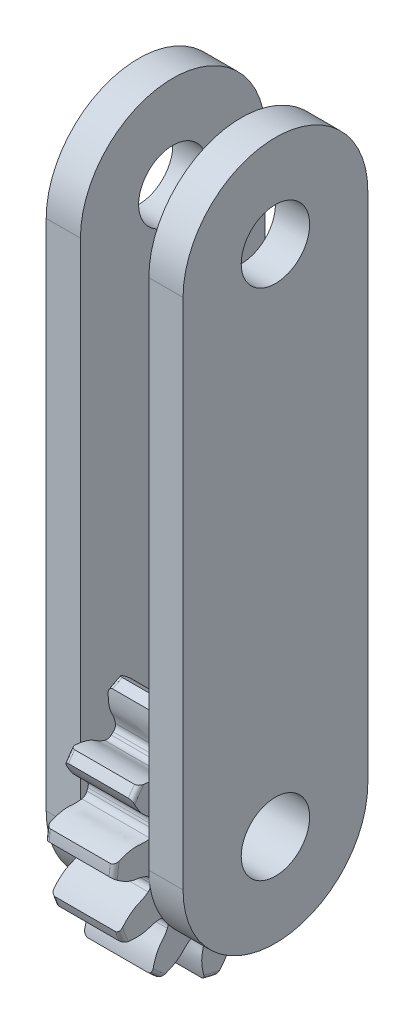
from build123d import *

# Parameters (mm, degrees)
SKETCH1_W                = 9
SKETCH1_H                = 7.5
CUT_EXTRUDE1_DEPTH       = 14.910427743
CUT_EXTRUDE2_DEPTH       = 14.910427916
CUT_EXTRUDE3_DEPTH       = 14.910427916
CUT_EXTRUDE4_DEPTH       = 14.910427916
CUT_EXTRUDE5_DEPTH       = 14.910427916
CUT_EXTRUDE6_DEPTH       = 14.910427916
CUT_EXTRUDE7_DEPTH       = 14.910427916
CUT_EXTRUDE8_DEPTH       = 14.910427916
CUT_EXTRUDE9_DEPTH       = 14.910427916
CUT_EXTRUDE10_DEPTH      = 14.910427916
CUT_EXTRUDE11_DEPTH      = 14.897973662
CUT_EXTRUDE12_DEPTH      = 14.897973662
CUT_EXTRUDE13_DEPTH      = 14.897973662
FILLET2_R                = 0.39
SKETCH15_W               = 7.292048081
SKETCH15_H               = 20.876726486
SKETCH15_W_2             = 7.106970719
CUT_EXTRUDE14_DEPTH      = 10
CUT_EXTRUDE15_DEPTH      = 10
CUT_EXTRUDE15_DEPTH_BACK = 11.881345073
SKETCH18_W               = 4.393422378
SKETCH18_H               = 18.360571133
FILLET4_R                = 0.25
SKETCH19_R               = 2
BOSS_EXTRUDE1_DEPTH      = 2
BOSS_EXTRUDE2_START      = -6
SKETCH19_2_R             = 2
BOSS_EXTRUDE2_DEPTH      = 2
SKETCH20_R               = 2
CUT_EXTRUDE16_DEPTH      = 5


with BuildPart() as part:
    # Sketch1 → Revolve1 (revolve)
    with BuildSketch(Plane.XY, mode=Mode.PRIVATE) as revolve1_sk:
        with Locations((0, 3.75)):
            Rectangle(SKETCH1_W, SKETCH1_H)
    revolve(revolve1_sk.sketch.rotate(Axis((-4.5, 0, 0), (1, 0, 0)), 270), axis=Axis((-4.5, 0, 0), (1, 0, 0)))

    # Sketch2 → Cut-Extrude1 (cut, through all)
    with BuildSketch(Plane.ZY.offset(4.5)):
        with BuildLine():
            ThreePointArc((3.201594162, 6.782314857), (1.794867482, 7.282063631), (0.317028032, 7.493296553))
            add(Edge.make_bspline(
                [(0.317028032, 7.493296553), (0.371871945, 7.408970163), (0.423858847, 7.32269625), (0.47240366, 7.234592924), (0.55951672, 7.076492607), (0.636261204, 6.911885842), (0.697729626, 6.742162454), (0.77567653, 6.526939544), (0.83047634, 6.296563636), (0.826790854, 6.067690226), (0.823538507, 5.865715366), (0.858399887, 5.661440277), (0.918999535, 5.468743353), (0.941929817, 5.395828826), (0.966010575, 5.323281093), (0.989559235, 5.250563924)],
                knots=[-0.0003014, -0.0003014, -0.0003014, -0.0003014, 0, 0, 0, 0.000541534, 0.000541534, 0.000541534, 0.001234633, 0.001234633, 0.001234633, 0.001842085, 0.001842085, 0.001842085, 0.002069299, 0.002069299, 0.002069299, 0.002069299], degree=3))
            ThreePointArc((0.989559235, 5.250563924), (1.278663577, 5.187742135), (1.5638475, 5.109014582))
            add(Edge.make_bspline(
                [(1.5638475, 5.109014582), (1.618492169, 5.162458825), (1.673529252, 5.215505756), (1.727718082, 5.269412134), (1.888913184, 5.429767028), (2.014491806, 5.625477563), (2.123183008, 5.825186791), (2.250960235, 6.059964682), (2.453612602, 6.251567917), (2.66167207, 6.419374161), (2.752319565, 6.492484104), (2.846626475, 6.561254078), (2.943790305, 6.625450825), (3.027718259, 6.680902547), (3.113843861, 6.733134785), (3.201594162, 6.782314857)],
                knots=[-0.000226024, -0.000226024, -0.000226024, -0.000226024, 0, 0, 0, 0.000682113, 0.000682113, 0.000682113, 0.001501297, 0.001501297, 0.001501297, 0.001854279, 0.001854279, 0.001854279, 0.002159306, 0.002159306, 0.002159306, 0.002159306], degree=3))
        make_face()
    extrude(amount=-CUT_EXTRUDE1_DEPTH, mode=Mode.SUBTRACT)

    # Sketch3 → Cut-Extrude2 (cut, through all)
    with BuildSketch(Plane.ZY.offset(4.5)):
        with BuildLine():
            ThreePointArc((5.986769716, 4.517586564), (4.973419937, 5.613830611), (3.763022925, 6.487654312))
            add(Edge.make_bspline(
                [(3.763022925, 6.487654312), (3.77239637, 6.387499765), (3.778335, 6.28694849), (3.78037564, 6.186376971), (3.784037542, 6.005902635), (3.77549483, 5.824485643), (3.751048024, 5.645637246), (3.720047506, 5.418843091), (3.661509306, 5.189388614), (3.551883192, 4.988444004), (3.455140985, 4.811115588), (3.391077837, 4.614038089), (3.355185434, 4.415251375), (3.34160412, 4.340032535), (3.329211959, 4.264603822), (3.316269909, 4.189272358)],
                knots=[-0.0003014, -0.0003014, -0.0003014, -0.0003014, 0, 0, 0, 0.000541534, 0.000541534, 0.000541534, 0.001234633, 0.001234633, 0.001234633, 0.001842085, 0.001842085, 0.001842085, 0.002069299, 0.002069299, 0.002069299, 0.002069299], degree=3))
            ThreePointArc((3.316269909, 4.189272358), (3.543064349, 3.99929294), (3.758995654, 3.797051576))
            add(Edge.make_bspline(
                [(3.758995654, 3.797051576), (3.832217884, 3.818979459), (3.905602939, 3.840373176), (3.978636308, 3.862922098), (4.195888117, 3.929998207), (4.398033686, 4.044931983), (4.587084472, 4.171254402), (4.809332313, 4.319758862), (5.077814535, 4.39523785), (5.340025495, 4.447132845), (5.454265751, 4.469742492), (5.569729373, 4.486808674), (5.685597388, 4.498497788), (5.7856816, 4.508594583), (5.886215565, 4.51481937), (5.986769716, 4.517586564)],
                knots=[-0.000226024, -0.000226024, -0.000226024, -0.000226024, 0, 0, 0, 0.000682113, 0.000682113, 0.000682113, 0.001501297, 0.001501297, 0.001501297, 0.001854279, 0.001854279, 0.001854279, 0.002159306, 0.002159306, 0.002159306, 0.002159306], degree=3))
        make_face()
    extrude(amount=-CUT_EXTRUDE2_DEPTH, mode=Mode.SUBTRACT)

    # Sketch4 → Cut-Extrude3 (cut, through all)
    with BuildSketch(Plane.ZY.offset(4.5)):
        with BuildLine():
            ThreePointArc((7.400448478, 1.217933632), (7.01262182, 2.659536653), (6.346954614, 3.995768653))
            add(Edge.make_bspline(
                [(6.346954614, 3.995768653), (6.308710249, 3.902730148), (6.267240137, 3.810936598), (6.222309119, 3.720936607), (6.141680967, 3.559432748), (6.049808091, 3.402765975), (5.945046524, 3.255764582), (5.81220043, 3.06935499), (5.653734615, 2.893387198), (5.463281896, 2.766405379), (5.295212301, 2.654347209), (5.14690072, 2.50961538), (5.022738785, 2.350278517), (4.97575719, 2.289987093), (4.929731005, 2.228957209), (4.883263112, 2.168268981)],
                knots=[-0.0003014, -0.0003014, -0.0003014, -0.0003014, 0, 0, 0, 0.000541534, 0.000541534, 0.000541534, 0.001234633, 0.001234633, 0.001234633, 0.001842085, 0.001842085, 0.001842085, 0.002069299, 0.002069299, 0.002069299, 0.002069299], degree=3))
            ThreePointArc((4.883263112, 2.168268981), (4.995791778, 1.894653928), (5.093003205, 1.615229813))
            add(Edge.make_bspline(
                [(5.093003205, 1.615229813), (5.168028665, 1.600617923), (5.24295006, 1.585457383), (5.318096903, 1.571483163), (5.541635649, 1.529914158), (5.77403905, 1.537741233), (6.000140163, 1.561737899), (6.265944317, 1.589948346), (6.538750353, 1.532011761), (6.795043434, 1.456106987), (6.906705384, 1.423036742), (7.016874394, 1.384489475), (7.124902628, 1.34099312), (7.218215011, 1.303421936), (7.310126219, 1.262213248), (7.400448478, 1.217933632)],
                knots=[-0.000226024, -0.000226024, -0.000226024, -0.000226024, 0, 0, 0, 0.000682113, 0.000682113, 0.000682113, 0.001501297, 0.001501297, 0.001501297, 0.001854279, 0.001854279, 0.001854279, 0.002159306, 0.002159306, 0.002159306, 0.002159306], degree=3))
        make_face()
    extrude(amount=-CUT_EXTRUDE3_DEPTH, mode=Mode.SUBTRACT)

    # Sketch5 → Cut-Extrude4 (cut, through all)
    with BuildSketch(Plane.ZY.offset(4.5)):
        with BuildLine():
            ThreePointArc((7.118773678, -2.360733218), (7.445316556, -0.904025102), (7.476875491, 0.58850055))
            add(Edge.make_bspline(
                [(7.476875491, 0.58850055), (7.399774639, 0.523892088), (7.320396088, 0.461885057), (7.238786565, 0.403074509), (7.092339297, 0.297539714), (6.938183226, 0.20151363), (6.777106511, 0.120035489), (6.57284828, 0.01671465), (6.350757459, -0.065454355), (6.123108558, -0.089383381), (5.922214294, -0.110500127), (5.723630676, -0.169729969), (5.53964321, -0.253114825), (5.470024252, -0.284666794), (5.400908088, -0.317316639), (5.331559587, -0.349458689)],
                knots=[-0.0003014, -0.0003014, -0.0003014, -0.0003014, 0, 0, 0, 0.000541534, 0.000541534, 0.000541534, 0.001234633, 0.001234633, 0.001234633, 0.001842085, 0.001842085, 0.001842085, 0.002069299, 0.002069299, 0.002069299, 0.002069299], degree=3))
            ThreePointArc((5.331559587, -0.349458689), (5.304043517, -0.644027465), (5.260265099, -0.936621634))
            add(Edge.make_bspline(
                [(5.260265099, -0.936621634), (5.31990636, -0.98442589), (5.379200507, -1.03266759), (5.439245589, -1.079963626), (5.617861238, -1.220654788), (5.827281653, -1.321727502), (6.038636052, -1.405553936), (6.287103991, -1.504100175), (6.501737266, -1.68217976), (6.693398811, -1.868495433), (6.776902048, -1.949669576), (6.856538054, -2.034999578), (6.93197854, -2.123716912), (6.997142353, -2.20034897), (7.059375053, -2.279550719), (7.118773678, -2.360733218)],
                knots=[-0.000226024, -0.000226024, -0.000226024, -0.000226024, 0, 0, 0, 0.000682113, 0.000682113, 0.000682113, 0.001501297, 0.001501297, 0.001501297, 0.001854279, 0.001854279, 0.001854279, 0.002159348, 0.002159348, 0.002159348, 0.002159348], degree=3))
        make_face()
    extrude(amount=-CUT_EXTRUDE4_DEPTH, mode=Mode.SUBTRACT)

    # Sketch6 → Cut-Extrude5 (cut, through all)
    with BuildSketch(Plane.ZY.offset(4.5)):
        with BuildLine():
            ThreePointArc((5.206273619, -5.398584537), (6.172378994, -4.2604856), (6.893934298, -2.953585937))
            add(Edge.make_bspline(
                [(6.893934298, -2.953585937), (6.795639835, -2.974963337), (6.696537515, -2.992978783), (6.596945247, -3.007127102), (6.418228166, -3.032516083), (6.237104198, -3.045903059), (6.05661307, -3.043192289), (5.827735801, -3.039754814), (5.592898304, -3.009301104), (5.38020484, -2.924695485), (5.192508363, -2.850033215), (4.989145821, -2.810192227), (4.787482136, -2.798522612), (4.711174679, -2.79410695), (4.634802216, -2.790897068), (4.558460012, -2.787129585)],
                knots=[-0.000301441, -0.000301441, -0.000301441, -0.000301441, 0, 0, 0, 0.000541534, 0.000541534, 0.000541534, 0.001234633, 0.001234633, 0.001234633, 0.001842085, 0.001842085, 0.001842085, 0.002069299, 0.002069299, 0.002069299, 0.002069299], degree=3))
            ThreePointArc((4.558460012, -2.787129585), (4.397202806, -3.035169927), (4.222463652, -3.273904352))
            add(Edge.make_bspline(
                [(4.222463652, -3.273904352), (4.253057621, -3.343949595), (4.283140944, -3.414220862), (4.314328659, -3.484003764), (4.407102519, -3.691586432), (4.545564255, -3.878404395), (4.693753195, -4.050850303), (4.867963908, -4.253577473), (4.975254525, -4.511004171), (5.058377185, -4.765048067), (5.094592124, -4.875730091), (5.125451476, -4.988294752), (5.151021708, -5.101908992), (5.173108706, -5.200046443), (5.191406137, -5.299097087), (5.206273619, -5.398584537)],
                knots=[-0.000226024, -0.000226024, -0.000226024, -0.000226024, 0, 0, 0, 0.000682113, 0.000682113, 0.000682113, 0.001501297, 0.001501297, 0.001501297, 0.001854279, 0.001854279, 0.001854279, 0.002159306, 0.002159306, 0.002159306, 0.002159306], degree=3))
        make_face()
    extrude(amount=-CUT_EXTRUDE5_DEPTH, mode=Mode.SUBTRACT)

    # Sketch7 → Cut-Extrude6 (cut, through all)
    with BuildSketch(Plane.ZY.offset(4.5)):
        with BuildLine():
            ThreePointArc((2.741072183, -4.586302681), (2.483015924, -4.730991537), (2.217346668, -4.861175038))
            add(Edge.make_bspline(
                [(2.217346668, -4.861175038), (2.211884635, -4.937414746), (2.205865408, -5.013617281), (2.201051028, -5.089900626), (2.186729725, -5.316820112), (2.222512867, -5.546585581), (2.273588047, -5.768145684), (2.333631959, -6.028611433), (2.309000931, -6.306411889), (2.264542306, -6.569985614), (2.245172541, -6.684819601), (2.220185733, -6.798831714), (2.19002788, -6.911315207), (2.163978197, -7.008475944), (2.134148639, -7.104684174), (2.101079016, -7.199685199)],
                knots=[-0.000226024, -0.000226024, -0.000226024, -0.000226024, 0, 0, 0, 0.000682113, 0.000682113, 0.000682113, 0.001501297, 0.001501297, 0.001501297, 0.001854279, 0.001854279, 0.001854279, 0.002159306, 0.002159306, 0.002159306, 0.002159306], degree=3))
            ThreePointArc((2.101079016, -7.199685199), (3.48542379, -6.640920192), (4.731675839, -5.81904148))
            add(Edge.make_bspline(
                [(4.731675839, -5.81904148), (4.634705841, -5.792290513), (4.5385829, -5.762187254), (4.443823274, -5.728432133), (4.27377831, -5.66785899), (4.107179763, -5.595540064), (3.948622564, -5.509261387), (3.747559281, -5.399853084), (3.55377355, -5.263753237), (3.404761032, -5.0899951), (3.273261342, -4.936658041), (3.111707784, -4.806873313), (2.9385666, -4.702822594), (2.873051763, -4.663450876), (2.806919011, -4.625116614), (2.741072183, -4.586302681)],
                knots=[-0.0003014, -0.0003014, -0.0003014, -0.0003014, 0, 0, 0, 0.000541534, 0.000541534, 0.000541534, 0.001234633, 0.001234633, 0.001234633, 0.001842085, 0.001842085, 0.001842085, 0.002069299, 0.002069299, 0.002069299, 0.002069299], degree=3))
        make_face()
    extrude(amount=-CUT_EXTRUDE6_DEPTH, mode=Mode.SUBTRACT)

    # Sketch8 → Cut-Extrude7 (cut, through all)
    with BuildSketch(Plane.ZY.offset(4.5)):
        with BuildLine():
            ThreePointArc((-1.485447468, -7.351424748), (0, -7.5), (1.485447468, -7.351424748))
            add(Edge.make_bspline(
                [(1.485447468, -7.351424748), (1.412016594, -7.282673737), (1.340893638, -7.211348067), (1.272674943, -7.137422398), (1.150257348, -7.004763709), (1.036349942, -6.863306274), (0.936050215, -6.713225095), (0.808862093, -6.522910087), (0.700522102, -6.312342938), (0.649327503, -6.089238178), (0.604149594, -5.892354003), (0.521414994, -5.702357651), (0.416460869, -5.529762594), (0.376747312, -5.464454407), (0.336004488, -5.399777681), (0.295737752, -5.334809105)],
                knots=[-0.0003014, -0.0003014, -0.0003014, -0.0003014, 0, 0, 0, 0.000541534, 0.000541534, 0.000541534, 0.001234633, 0.001234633, 0.001234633, 0.001842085, 0.001842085, 0.001842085, 0.002069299, 0.002069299, 0.002069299, 0.002069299], degree=3))
            ThreePointArc((0.295737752, -5.334809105), (1.8e-08, -5.343), (-0.295737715, -5.334809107))
            add(Edge.make_bspline(
                [(-0.295737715, -5.334809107), (-0.336004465, -5.399777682), (-0.376747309, -5.464454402), (-0.416460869, -5.529762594), (-0.534596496, -5.72403438), (-0.609689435, -5.944110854), (-0.667428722, -6.164028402), (-0.735306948, -6.422563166), (-0.88621695, -6.657096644), (-1.048071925, -6.869818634), (-1.118589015, -6.962497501), (-1.193697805, -7.051838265), (-1.272674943, -7.137422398), (-1.340893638, -7.211348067), (-1.412016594, -7.282673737), (-1.485447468, -7.351424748)],
                knots=[-0.000226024, -0.000226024, -0.000226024, -0.000226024, 0, 0, 0, 0.000682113, 0.000682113, 0.000682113, 0.001501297, 0.001501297, 0.001501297, 0.001854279, 0.001854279, 0.001854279, 0.002159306, 0.002159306, 0.002159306, 0.002159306], degree=3))
        make_face()
    extrude(amount=-CUT_EXTRUDE7_DEPTH, mode=Mode.SUBTRACT)

    # Sketch9 → Cut-Extrude8 (cut, through all)
    with BuildSketch(Plane.ZY.offset(4.5)):
        with BuildLine():
            ThreePointArc((-4.731675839, -5.81904148), (-3.48542379, -6.640920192), (-2.101079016, -7.199685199))
            add(Edge.make_bspline(
                [(-2.101079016, -7.199685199), (-2.134148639, -7.104684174), (-2.163978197, -7.008475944), (-2.19002788, -6.911315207), (-2.23677371, -6.736961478), (-2.271895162, -6.558771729), (-2.290959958, -6.379269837), (-2.315135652, -6.151646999), (-2.313210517, -5.914850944), (-2.254859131, -5.693510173), (-2.203365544, -5.498182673), (-2.188327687, -5.291500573), (-2.201051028, -5.089900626), (-2.205865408, -5.013617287), (-2.211884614, -4.937414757), (-2.217346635, -4.861175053)],
                knots=[-0.0003014, -0.0003014, -0.0003014, -0.0003014, 0, 0, 0, 0.000541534, 0.000541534, 0.000541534, 0.001234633, 0.001234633, 0.001234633, 0.001842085, 0.001842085, 0.001842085, 0.002069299, 0.002069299, 0.002069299, 0.002069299], degree=3))
            ThreePointArc((-2.217346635, -4.861175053), (-2.483015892, -4.730991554), (-2.741072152, -4.5863027))
            add(Edge.make_bspline(
                [(-2.741072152, -4.5863027), (-2.806918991, -4.625116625), (-2.873051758, -4.663450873), (-2.9385666, -4.702822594), (-3.133453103, -4.819941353), (-3.302219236, -4.979911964), (-3.455545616, -5.147806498), (-3.635795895, -5.345183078), (-3.878413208, -5.482720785), (-4.120585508, -5.595858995), (-4.226095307, -5.64515113), (-4.334119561, -5.689353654), (-4.443823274, -5.728432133), (-4.5385829, -5.762187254), (-4.634705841, -5.792290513), (-4.731675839, -5.81904148)],
                knots=[-0.000226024, -0.000226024, -0.000226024, -0.000226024, 0, 0, 0, 0.000682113, 0.000682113, 0.000682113, 0.001501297, 0.001501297, 0.001501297, 0.001854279, 0.001854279, 0.001854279, 0.002159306, 0.002159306, 0.002159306, 0.002159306], degree=3))
        make_face()
    extrude(amount=-CUT_EXTRUDE8_DEPTH, mode=Mode.SUBTRACT)

    # Sketch10 → Cut-Extrude9 (cut, through all)
    with BuildSketch(Plane.ZY.offset(4.5)):
        with BuildLine():
            ThreePointArc((-6.893934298, -2.953585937), (-6.172378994, -4.2604856), (-5.206273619, -5.398584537))
            add(Edge.make_bspline(
                [(-5.206273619, -5.398584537), (-5.191406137, -5.299097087), (-5.173108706, -5.200046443), (-5.151021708, -5.101908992), (-5.111386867, -4.925802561), (-5.059676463, -4.751701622), (-4.993138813, -4.583900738), (-4.90876372, -4.371115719), (-4.797014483, -4.16233788), (-4.642484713, -3.993467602), (-4.50611619, -3.844443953), (-4.396750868, -3.668424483), (-4.314328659, -3.484003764), (-4.283140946, -3.414220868), (-4.253057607, -3.343949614), (-4.22246363, -3.273904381)],
                knots=[-0.0003014, -0.0003014, -0.0003014, -0.0003014, 0, 0, 0, 0.000541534, 0.000541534, 0.000541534, 0.001234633, 0.001234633, 0.001234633, 0.001842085, 0.001842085, 0.001842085, 0.002069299, 0.002069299, 0.002069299, 0.002069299], degree=3))
            ThreePointArc((-4.22246363, -3.273904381), (-4.397202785, -3.035169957), (-4.558459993, -2.787129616))
            add(Edge.make_bspline(
                [(-4.558459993, -2.787129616), (-4.634802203, -2.790897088), (-4.711174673, -2.794106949), (-4.787482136, -2.798522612), (-5.014473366, -2.811657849), (-5.238250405, -2.874875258), (-5.452038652, -2.952284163), (-5.703367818, -3.043285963), (-5.982111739, -3.052319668), (-6.24912261, -3.039955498), (-6.365454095, -3.034568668), (-6.481646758, -3.023506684), (-6.596945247, -3.007127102), (-6.696537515, -2.992978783), (-6.795639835, -2.974963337), (-6.893934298, -2.953585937)],
                knots=[-0.000226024, -0.000226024, -0.000226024, -0.000226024, 0, 0, 0, 0.000682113, 0.000682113, 0.000682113, 0.001501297, 0.001501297, 0.001501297, 0.001854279, 0.001854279, 0.001854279, 0.002159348, 0.002159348, 0.002159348, 0.002159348], degree=3))
        make_face()
    extrude(amount=-CUT_EXTRUDE9_DEPTH, mode=Mode.SUBTRACT)

    # Sketch11 → Cut-Extrude10 (cut, through all)
    with BuildSketch(Plane.ZY.offset(4.5)):
        with BuildLine():
            ThreePointArc((-7.476875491, 0.58850055), (-7.445316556, -0.904025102), (-7.118773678, -2.360733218))
            add(Edge.make_bspline(
                [(-7.118773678, -2.360733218), (-7.059375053, -2.279550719), (-6.997142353, -2.20034897), (-6.93197854, -2.123716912), (-6.815042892, -1.986201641), (-6.688346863, -1.856073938), (-6.55144974, -1.738415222), (-6.377853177, -1.589214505), (-6.181880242, -1.45628337), (-5.966572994, -1.37856973), (-5.776569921, -1.309989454), (-5.597931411, -1.204956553), (-5.439245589, -1.079963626), (-5.379200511, -1.032667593), (-5.319906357, -0.984425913), (-5.260265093, -0.93662167)],
                knots=[-0.0003014, -0.0003014, -0.0003014, -0.0003014, 0, 0, 0, 0.000541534, 0.000541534, 0.000541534, 0.001234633, 0.001234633, 0.001234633, 0.001842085, 0.001842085, 0.001842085, 0.002069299, 0.002069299, 0.002069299, 0.002069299], degree=3))
            ThreePointArc((-5.260265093, -0.93662167), (-5.304043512, -0.644027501), (-5.331559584, -0.349458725))
            add(Edge.make_bspline(
                [(-5.331559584, -0.349458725), (-5.400908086, -0.317316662), (-5.470024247, -0.284666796), (-5.53964321, -0.253114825), (-5.746738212, -0.159257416), (-5.974261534, -0.111239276), (-6.199535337, -0.080429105), (-6.464366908, -0.04420871), (-6.715380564, 0.077331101), (-6.946061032, 0.212365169), (-7.046564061, 0.271196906), (-7.144306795, 0.334989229), (-7.238786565, 0.403074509), (-7.320396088, 0.461885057), (-7.399774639, 0.523892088), (-7.476875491, 0.58850055)],
                knots=[-0.000226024, -0.000226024, -0.000226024, -0.000226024, 0, 0, 0, 0.000682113, 0.000682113, 0.000682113, 0.001501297, 0.001501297, 0.001501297, 0.001854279, 0.001854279, 0.001854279, 0.002159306, 0.002159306, 0.002159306, 0.002159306], degree=3))
        make_face()
    extrude(amount=-CUT_EXTRUDE10_DEPTH, mode=Mode.SUBTRACT)

    # Sketch12 → Cut-Extrude11 (cut, through all)
    with BuildSketch(Plane.ZY.offset(4.5)):
        with BuildLine():
            ThreePointArc((-6.346954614, 3.995768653), (-7.01262182, 2.659536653), (-7.400448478, 1.217933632))
            add(Edge.make_bspline(
                [(-7.400448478, 1.217933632), (-7.310126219, 1.262213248), (-7.218215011, 1.303421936), (-7.124902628, 1.340993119), (-6.957454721, 1.40841414), (-6.784797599, 1.464757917), (-6.608902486, 1.505320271), (-6.385853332, 1.556756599), (-6.150551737, 1.58338811), (-5.923791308, 1.552141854), (-5.723681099, 1.524567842), (-5.516693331, 1.534552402), (-5.318096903, 1.571483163), (-5.242950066, 1.585457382), (-5.168028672, 1.600617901), (-5.093003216, 1.615229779)],
                knots=[-0.0003014, -0.0003014, -0.0003014, -0.0003014, 0, 0, 0, 0.000541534, 0.000541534, 0.000541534, 0.001234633, 0.001234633, 0.001234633, 0.001842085, 0.001842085, 0.001842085, 0.002069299, 0.002069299, 0.002069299, 0.002069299], degree=3))
            ThreePointArc((-5.093003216, 1.615229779), (-4.995791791, 1.894653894), (-4.883263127, 2.168268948))
            add(Edge.make_bspline(
                [(-4.883263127, 2.168268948), (-4.929731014, 2.228957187), (-4.975757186, 2.289987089), (-5.022738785, 2.350278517), (-5.162494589, 2.529626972), (-5.341641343, 2.677880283), (-5.526793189, 2.809851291), (-5.744457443, 2.964996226), (-5.91023663, 3.189266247), (-6.051740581, 3.416035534), (-6.113391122, 3.514834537), (-6.170292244, 3.616743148), (-6.222309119, 3.720936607), (-6.267240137, 3.810936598), (-6.308710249, 3.902730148), (-6.346954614, 3.995768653)],
                knots=[-0.000226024, -0.000226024, -0.000226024, -0.000226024, 0, 0, 0, 0.000682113, 0.000682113, 0.000682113, 0.001501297, 0.001501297, 0.001501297, 0.001854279, 0.001854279, 0.001854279, 0.002159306, 0.002159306, 0.002159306, 0.002159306], degree=3))
        make_face()
    extrude(amount=-CUT_EXTRUDE11_DEPTH, mode=Mode.SUBTRACT)

    # Sketch13 → Cut-Extrude12 (cut, through all)
    with BuildSketch(Plane.ZY.offset(4.5)):
        with BuildLine():
            ThreePointArc((-3.763022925, 6.487654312), (-4.973419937, 5.613830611), (-5.986769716, 4.517586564))
            add(Edge.make_bspline(
                [(-5.986769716, 4.517586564), (-5.886215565, 4.51481937), (-5.7856816, 4.508594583), (-5.685597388, 4.498497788), (-5.505997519, 4.480379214), (-5.326932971, 4.450031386), (-5.152335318, 4.404205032), (-4.930931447, 4.346093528), (-4.710205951, 4.260324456), (-4.523940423, 4.127276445), (-4.359565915, 4.009865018), (-4.171647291, 3.922513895), (-3.978636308, 3.862922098), (-3.905602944, 3.840373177), (-3.832217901, 3.818979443), (-3.75899568, 3.79705155)],
                knots=[-0.0003014, -0.0003014, -0.0003014, -0.0003014, 0, 0, 0, 0.000541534, 0.000541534, 0.000541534, 0.001234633, 0.001234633, 0.001234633, 0.001842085, 0.001842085, 0.001842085, 0.002069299, 0.002069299, 0.002069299, 0.002069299], degree=3))
            ThreePointArc((-3.75899568, 3.79705155), (-3.543064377, 3.999292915), (-3.316269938, 4.189272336))
            add(Edge.make_bspline(
                [(-3.316269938, 4.189272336), (-3.329211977, 4.264603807), (-3.341604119, 4.340032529), (-3.355185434, 4.415251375), (-3.395585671, 4.639004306), (-3.485315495, 4.853529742), (-3.587929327, 5.056428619), (-3.708562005, 5.294956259), (-3.751128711, 5.57057893), (-3.771039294, 5.837133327), (-3.77971395, 5.953265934), (-3.782738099, 6.069944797), (-3.78037564, 6.186376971), (-3.778335, 6.28694849), (-3.77239637, 6.387499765), (-3.763022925, 6.487654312)],
                knots=[-0.000226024, -0.000226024, -0.000226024, -0.000226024, 0, 0, 0, 0.000682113, 0.000682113, 0.000682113, 0.001501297, 0.001501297, 0.001501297, 0.001854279, 0.001854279, 0.001854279, 0.002159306, 0.002159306, 0.002159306, 0.002159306], degree=3))
        make_face()
    extrude(amount=-CUT_EXTRUDE12_DEPTH, mode=Mode.SUBTRACT)

    # Sketch14 → Cut-Extrude13 (cut, through all)
    with BuildSketch(Plane.ZY.offset(4.5)):
        with BuildLine():
            ThreePointArc((-0.317028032, 7.493296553), (-1.794867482, 7.282063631), (-3.201594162, 6.782314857))
            add(Edge.make_bspline(
                [(-3.201594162, 6.782314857), (-3.113843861, 6.733134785), (-3.027718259, 6.680902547), (-2.943790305, 6.625450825), (-2.79318264, 6.525943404), (-2.648732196, 6.415856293), (-2.51543022, 6.294139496), (-2.346392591, 6.139792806), (-2.190808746, 5.961271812), (-2.087709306, 5.756901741), (-1.996726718, 5.576550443), (-1.870927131, 5.411874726), (-1.727718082, 5.269412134), (-1.673529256, 5.21550576), (-1.618492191, 5.162458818), (-1.563847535, 5.109014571)],
                knots=[-0.0003014, -0.0003014, -0.0003014, -0.0003014, 0, 0, 0, 0.000541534, 0.000541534, 0.000541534, 0.001234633, 0.001234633, 0.001234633, 0.001842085, 0.001842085, 0.001842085, 0.002069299, 0.002069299, 0.002069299, 0.002069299], degree=3))
            ThreePointArc((-1.563847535, 5.109014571), (-1.278663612, 5.187742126), (-0.989559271, 5.250563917))
            add(Edge.make_bspline(
                [(-0.989559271, 5.250563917), (-0.966010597, 5.323281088), (-0.941929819, 5.39582882), (-0.918999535, 5.468743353), (-0.850788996, 5.68564166), (-0.830545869, 5.917294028), (-0.827114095, 6.144639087), (-0.823079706, 6.411905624), (-0.732682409, 6.675739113), (-0.62643835, 6.921014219), (-0.580149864, 7.02787585), (-0.528604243, 7.132595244), (-0.47240366, 7.234592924), (-0.423858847, 7.32269625), (-0.371871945, 7.408970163), (-0.317028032, 7.493296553)],
                knots=[-0.000226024, -0.000226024, -0.000226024, -0.000226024, 0, 0, 0, 0.000682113, 0.000682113, 0.000682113, 0.001501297, 0.001501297, 0.001501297, 0.001854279, 0.001854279, 0.001854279, 0.002159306, 0.002159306, 0.002159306, 0.002159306], degree=3))
        make_face()
    extrude(amount=-CUT_EXTRUDE13_DEPTH, mode=Mode.SUBTRACT)

    # Fillet2
    fillet2_edges = [part.edges().sort_by_distance(p)[0] for p in [
        (0, -4.861175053, -2.217346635),
        (0, 4.189272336, -3.316269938),
        (0, -0.349458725, -5.331559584),
        (0, 5.250563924, 0.989559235),
        (0, -5.334809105, 0.295737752),
        (0, 5.109014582, 1.5638475),
        (0, -2.787129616, -4.558459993),
        (0, 4.189272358, 3.316269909),
        (0, 2.168268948, -4.883263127),
        (0, 3.797051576, 3.758995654),
        (0, 5.250563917, -0.989559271),
        (0, 2.168268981, 4.883263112),
        (0, -5.334809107, -0.295737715),
        (0, 1.615229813, 5.093003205),
        (0, -4.5863027, -2.741072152),
        (0, -0.349458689, 5.331559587),
        (0, -0.93662167, -5.260265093),
        (0, -0.936621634, 5.260265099),
        (0, 1.615229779, -5.093003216),
        (0, -2.787129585, 4.558460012),
        (0, 3.79705155, -3.75899568),
        (0, -3.273904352, 4.222463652),
        (0, 5.109014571, -1.563847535),
        (0, -4.586302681, 2.741072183),
        (0, -4.861175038, 2.217346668),
        (0, -3.273904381, -4.22246363),
    ]]
    fillet(fillet2_edges, radius=FILLET2_R)

    # Sketch15 → Cut-Extrude14 (cut, symmetric)
    with BuildSketch(Plane(origin=(0, 0, 0), x_dir=(1, 0, 0), z_dir=(0, 1, 0))):
        with Locations((-6.146024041, 0.536724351)):
            Rectangle(SKETCH15_W, SKETCH15_H)
        with Locations((6.05348536, 0.536724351)):
            Rectangle(SKETCH15_W_2, SKETCH15_H)
    extrude(amount=CUT_EXTRUDE14_DEPTH, both=True, mode=Mode.SUBTRACT)

    # Sketch18 → Cut-Extrude15 (cut, two sides: drawn at the far end of the back side and taken through both)
    with BuildSketch(Plane.XY.offset(-CUT_EXTRUDE15_DEPTH_BACK)):
        with Locations((3.696711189, 0.333229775)):
            Rectangle(SKETCH18_W, SKETCH18_H)
    extrude(amount=CUT_EXTRUDE15_DEPTH + CUT_EXTRUDE15_DEPTH_BACK, mode=Mode.SUBTRACT)

    # Fillet4
    fillet4_edges = [part.edges().sort_by_distance(p)[0] for p in [
        (-2.5, 4.2604856, 6.172378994),
        (1.5, 4.2604856, 6.172378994),
        (1.5, 0.904025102, 7.445316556),
        (-2.5, 0.904025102, 7.445316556),
        (-2.5, -2.659536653, 7.01262182),
        (1.5, -2.659536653, 7.01262182),
        (1.5, -5.613830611, 4.973419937),
        (-2.5, -5.613830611, 4.973419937),
        (-2.5, -7.282063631, 1.794867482),
        (1.5, -7.282063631, 1.794867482),
        (1.5, -7.282063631, -1.794867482),
        (-2.5, -7.282063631, -1.794867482),
        (1.5, -5.613830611, -4.973419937),
        (-2.5, -5.613830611, -4.973419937),
        (1.5, -2.659536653, -7.01262182),
        (-2.5, -2.659536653, -7.01262182),
        (-2.5, 0.904025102, -7.445316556),
        (1.5, 0.904025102, -7.445316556),
        (1.5, 4.2604856, -6.172378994),
        (-2.5, 4.2604856, -6.172378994),
        (-2.5, 6.640920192, -3.48542379),
        (1.5, 6.640920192, -3.48542379),
        (1.5, 7.5, 0),
        (-2.5, 7.5, 0),
        (1.5, 6.640920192, 3.48542379),
        (-2.5, 6.640920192, 3.48542379),
    ]]
    fillet(fillet4_edges, radius=FILLET4_R)

    # Sketch19 → Boss-Extrude1 (add)
    with BuildSketch(Plane.ZY.offset(2.5)):
        with BuildLine():
            Line((5.4, 0), (5.4, 30))
            ThreePointArc((5.4, 30), (0, 35.4), (-5.4, 30))
            Line((-5.4, 30), (-5.4, 0))
            ThreePointArc((-5.4, 0), (0, -5.4), (5.4, 0))
        make_face()
        with Locations((0, 30)):
            Circle(SKETCH19_R, mode=Mode.SUBTRACT)
    extrude(amount=BOSS_EXTRUDE1_DEPTH)

    # Sketch19_2 → Boss-Extrude2 (add)
    with BuildSketch(Plane.ZY.offset(2.5).offset(BOSS_EXTRUDE2_START)):
        with BuildLine():
            Line((5.4, 0), (5.4, 30))
            ThreePointArc((5.4, 30), (0, 35.4), (-5.4, 30))
            Line((-5.4, 30), (-5.4, 0))
            ThreePointArc((-5.4, 0), (0, -5.4), (5.4, 0))
        make_face()
        with Locations((0, 30)):
            Circle(SKETCH19_2_R, mode=Mode.SUBTRACT)
    extrude(amount=BOSS_EXTRUDE2_DEPTH)

    # Sketch20 → Cut-Extrude16 (cut, symmetric)
    with BuildSketch(Plane(origin=(0, 0, 0), x_dir=(0, 0, -1), z_dir=(1, 0, 0))):
        with Locations(Location((0, 0, 0), (0, 0, 180))):
            Circle(SKETCH20_R)
    extrude(amount=CUT_EXTRUDE16_DEPTH, both=True, mode=Mode.SUBTRACT)


solid = part.part
